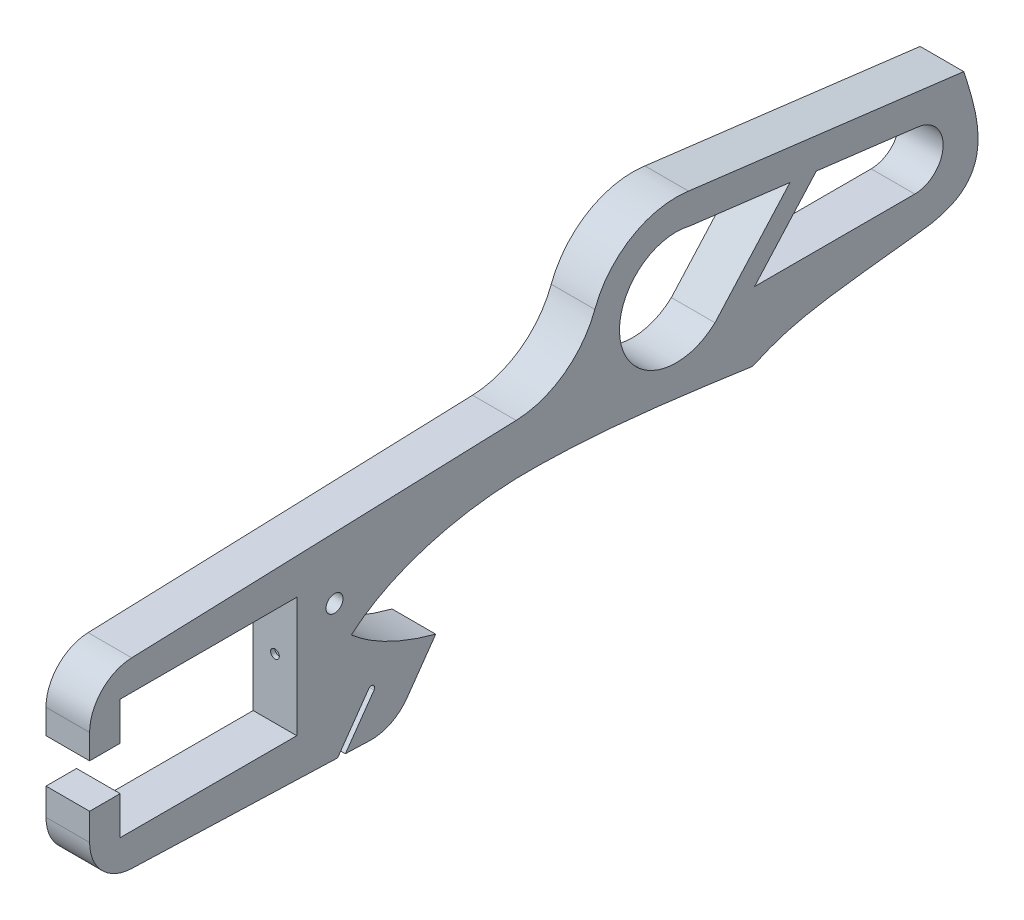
ISO-10303-21;
HEADER;
FILE_DESCRIPTION(('STEP AP214'),'2;1');
FILE_NAME('part.step','',(''),(''),'','','');
FILE_SCHEMA(('AUTOMOTIVE_DESIGN { 1 0 10303 214 1 1 1 1 }'));
ENDSEC;
DATA;
#1=APPLICATION_CONTEXT('core data for automotive mechanical design processes');
#2=APPLICATION_PROTOCOL_DEFINITION('international standard','automotive_design',2000,#1);
#3=PRODUCT_CONTEXT('',#1,'mechanical');
#4=PRODUCT('Part','Part','',(#3));
#5=PRODUCT_RELATED_PRODUCT_CATEGORY('part','',(#4));
#6=PRODUCT_DEFINITION_FORMATION('','',#4);
#7=PRODUCT_DEFINITION_CONTEXT('part definition',#1,'design');
#8=PRODUCT_DEFINITION('design','',#6,#7);
#9=PRODUCT_DEFINITION_SHAPE('','',#8);
#10=(LENGTH_UNIT() NAMED_UNIT(*) SI_UNIT(.MILLI.,.METRE.));
#11=(NAMED_UNIT(*) PLANE_ANGLE_UNIT() SI_UNIT($,.RADIAN.));
#12=(NAMED_UNIT(*) SI_UNIT($,.STERADIAN.) SOLID_ANGLE_UNIT());
#13=UNCERTAINTY_MEASURE_WITH_UNIT(LENGTH_MEASURE(1.E-05),#10,'distance_accuracy_value','');
#14=(GEOMETRIC_REPRESENTATION_CONTEXT(3) GLOBAL_UNCERTAINTY_ASSIGNED_CONTEXT((#13)) GLOBAL_UNIT_ASSIGNED_CONTEXT((#10,
#11,#12)) REPRESENTATION_CONTEXT('',''));
#15=CARTESIAN_POINT('',(0.,0.,0.));
#16=DIRECTION('',(0.,0.,1.));
#17=DIRECTION('',(1.,0.,0.));
#18=AXIS2_PLACEMENT_3D('',#15,#16,#17);
#19=CARTESIAN_POINT('',(10.,-21.2031451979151,50.3478824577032));
#20=DIRECTION('',(0.,0.99939470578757,-0.0347882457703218));
#21=DIRECTION('',(0.,0.0347882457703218,0.99939470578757));
#22=AXIS2_PLACEMENT_3D('',#19,#20,#21);
#23=PLANE('',#22);
#24=DIRECTION('',(0.,-0.0347882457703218,-0.99939470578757));
#25=VECTOR('',#24,1.);
#26=CARTESIAN_POINT('',(0.,-21.2031451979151,50.3478824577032));
#27=LINE('',#26,#25);
#28=CARTESIAN_POINT('',(0.,-21.2031451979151,50.3478824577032));
#29=VERTEX_POINT('',#28);
#30=CARTESIAN_POINT('',(0.,-22.8463212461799,3.14281629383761));
#31=VERTEX_POINT('',#30);
#32=EDGE_CURVE('E501',#29,#31,#27,.T.);
#33=ORIENTED_EDGE('',*,*,#32,.T.);
#34=DIRECTION('',(1.,0.,0.));
#35=VECTOR('',#34,1.);
#36=CARTESIAN_POINT('',(10.,-22.8463212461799,3.14281629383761));
#37=LINE('',#36,#35);
#38=CARTESIAN_POINT('',(10.,-22.8463212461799,3.14281629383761));
#39=VERTEX_POINT('',#38);
#40=EDGE_CURVE('E11',#31,#39,#37,.T.);
#41=ORIENTED_EDGE('',*,*,#40,.T.);
#42=DIRECTION('',(0.,-0.0347882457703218,-0.99939470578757));
#43=VECTOR('',#42,1.);
#44=CARTESIAN_POINT('',(10.,-21.2031451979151,50.3478824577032));
#45=LINE('',#44,#43);
#46=CARTESIAN_POINT('',(10.,-21.2031451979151,50.3478824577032));
#47=VERTEX_POINT('',#46);
#48=EDGE_CURVE('E591',#47,#39,#45,.T.);
#49=ORIENTED_EDGE('',*,*,#48,.F.);
#50=DIRECTION('',(-1.,0.,0.));
#51=VECTOR('',#50,1.);
#52=CARTESIAN_POINT('',(10.,-21.2031451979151,50.3478824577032));
#53=LINE('',#52,#51);
#54=EDGE_CURVE('E504',#47,#29,#53,.T.);
#55=ORIENTED_EDGE('',*,*,#54,.T.);
#56=EDGE_LOOP('',(#33,#41,#49,#55));
#57=FACE_BOUND('',#56,.T.);
#58=ADVANCED_FACE('F32',(#57),#23,.F.);
#59=CARTESIAN_POINT('',(10.,-5.70252850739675,-8.87915586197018));
#60=DIRECTION('',(-1.,0.,0.));
#61=DIRECTION('',(0.,0.,1.));
#62=AXIS2_PLACEMENT_3D('',#59,#60,#61);
#63=PLANE('',#62);
#64=DIRECTION('',(0.,0.12305429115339,0.992399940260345));
#65=VECTOR('',#64,1.);
#66=CARTESIAN_POINT('',(10.,35.9106898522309,-130.003351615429));
#67=LINE('',#66,#65);
#68=CARTESIAN_POINT('',(10.,35.9106898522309,-130.003351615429));
#69=VERTEX_POINT('',#68);
#70=CARTESIAN_POINT('',(10.,38.8092630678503,-106.62713402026));
#71=VERTEX_POINT('',#70);
#72=EDGE_CURVE('E284',#69,#71,#67,.T.);
#73=ORIENTED_EDGE('',*,*,#72,.F.);
#74=CARTESIAN_POINT('',(10.,29.4592694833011,-129.203396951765));
#75=DIRECTION('',(1.,0.,0.));
#76=DIRECTION('',(0.,0.,-1.));
#77=AXIS2_PLACEMENT_3D('',#74,#75,#76);
#78=CIRCLE('',#77,6.50082704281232);
#79=CARTESIAN_POINT('',(10.,22.9584424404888,-129.203396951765));
#80=VERTEX_POINT('',#79);
#81=EDGE_CURVE('E291',#80,#69,#78,.T.);
#82=ORIENTED_EDGE('',*,*,#81,.F.);
#83=DIRECTION('',(0.,0.,-1.));
#84=VECTOR('',#83,1.);
#85=CARTESIAN_POINT('',(10.,22.9584424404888,-92.4604924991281));
#86=LINE('',#85,#84);
#87=CARTESIAN_POINT('',(10.,22.9584424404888,-92.4604924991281));
#88=VERTEX_POINT('',#87);
#89=EDGE_CURVE('E289',#88,#80,#86,.T.);
#90=ORIENTED_EDGE('',*,*,#89,.F.);
#91=DIRECTION('',(0.,-0.745607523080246,0.66638534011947));
#92=VECTOR('',#91,1.);
#93=CARTESIAN_POINT('',(10.,38.8092630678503,-106.62713402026));
#94=LINE('',#93,#92);
#95=EDGE_CURVE('E286',#71,#88,#94,.T.);
#96=ORIENTED_EDGE('',*,*,#95,.F.);
#97=EDGE_LOOP('',(#73,#82,#90,#96));
#98=FACE_BOUND('',#97,.T.);
#99=ORIENTED_EDGE('',*,*,#48,.T.);
#100=DIRECTION('',(0.,0.818234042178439,-0.574885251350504));
#101=VECTOR('',#100,1.);
#102=CARTESIAN_POINT('',(10.,-12.6791192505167,-4.00058543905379));
#103=LINE('',#102,#101);
#104=CARTESIAN_POINT('',(10.,-12.6791192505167,-4.00058543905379));
#105=VERTEX_POINT('',#104);
#106=EDGE_CURVE('E252',#39,#105,#103,.T.);
#107=ORIENTED_EDGE('',*,*,#106,.T.);
#108=CARTESIAN_POINT('',(10.,-13.1102831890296,-4.61426097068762));
#109=DIRECTION('',(-1.,0.,0.));
#110=DIRECTION('',(0.,0.,1.));
#111=AXIS2_PLACEMENT_3D('',#108,#109,#110);
#112=CIRCLE('',#111,0.749999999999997);
#113=CARTESIAN_POINT('',(10.,-13.5414471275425,-5.22793650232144));
#114=VERTEX_POINT('',#113);
#115=EDGE_CURVE('E247',#105,#114,#112,.T.);
#116=ORIENTED_EDGE('',*,*,#115,.T.);
#117=DIRECTION('',(0.,-0.818234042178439,0.574885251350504));
#118=VECTOR('',#117,1.);
#119=CARTESIAN_POINT('',(10.,-24.4721318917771,2.45188263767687));
#120=LINE('',#119,#118);
#121=CARTESIAN_POINT('',(10.,-22.908610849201,1.35336419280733));
#122=VERTEX_POINT('',#121);
#123=EDGE_CURVE('E255',#114,#122,#120,.T.);
#124=ORIENTED_EDGE('',*,*,#123,.T.);
#125=CARTESIAN_POINT('',(10.,-23.1042302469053,-4.26637851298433));
#126=VERTEX_POINT('',#125);
#127=EDGE_CURVE('E579',#122,#126,#45,.T.);
#128=ORIENTED_EDGE('',*,*,#127,.T.);
#129=CARTESIAN_POINT('',(10.,-13.1102831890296,-4.61426097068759));
#130=DIRECTION('',(1.,0.,0.));
#131=DIRECTION('',(0.,0.,1.));
#132=AXIS2_PLACEMENT_3D('',#129,#130,#131);
#133=CIRCLE('',#132,10.);
#134=CARTESIAN_POINT('',(10.,-18.8591357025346,-12.796601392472));
#135=VERTEX_POINT('',#134);
#136=EDGE_CURVE('E589',#126,#135,#133,.T.);
#137=ORIENTED_EDGE('',*,*,#136,.T.);
#138=DIRECTION('',(0.,0.818234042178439,-0.574885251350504));
#139=VECTOR('',#138,1.);
#140=CARTESIAN_POINT('',(10.,-18.8591357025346,-12.796601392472));
#141=LINE('',#140,#139);
#142=CARTESIAN_POINT('',(10.,-9.51292470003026,-19.3631808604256));
#143=VERTEX_POINT('',#142);
#144=EDGE_CURVE('E520',#135,#143,#141,.T.);
#145=ORIENTED_EDGE('',*,*,#144,.T.);
#146=CARTESIAN_POINT('',(10.,-9.51292470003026,-19.3631808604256));
#147=CARTESIAN_POINT('',(10.,-7.56237200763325,-12.0547036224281));
#148=CARTESIAN_POINT('',(10.,-4.473395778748,-5.16865172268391));
#149=CARTESIAN_POINT('',(10.,0.,0.));
#150=B_SPLINE_CURVE_WITH_KNOTS('',3,(#146,#147,#148,#149),.UNSPECIFIED.,.F.,.F.,(4,4),(0.,
0.144432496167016),.UNSPECIFIED.);
#151=CARTESIAN_POINT('',(10.,0.,0.));
#152=VERTEX_POINT('',#151);
#153=EDGE_CURVE('E336',#143,#152,#150,.T.);
#154=ORIENTED_EDGE('',*,*,#153,.T.);
#155=CARTESIAN_POINT('',(10.,0.,0.));
#156=CARTESIAN_POINT('',(10.,8.67468810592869,-10.0229096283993));
#157=CARTESIAN_POINT('',(10.,12.1434163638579,-26.5039167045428));
#158=CARTESIAN_POINT('',(10.,12.2542951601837,-52.9502459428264));
#159=CARTESIAN_POINT('',(10.,10.36179643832,-70.5875064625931));
#160=CARTESIAN_POINT('',(10.,7.89754196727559,-88.025709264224));
#161=CARTESIAN_POINT('',(10.,7.32862418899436,-92.0238097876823));
#162=B_SPLINE_CURVE_WITH_KNOTS('',3,(#155,#156,#157,#158,#159,#160,#161),.UNSPECIFIED.,.F.,.F.,
(4,2,1,4),(0.,0.280079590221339,0.548831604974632,0.629025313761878),.UNSPECIFIED.);
#163=CARTESIAN_POINT('',(10.,7.32862418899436,-92.0238097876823));
#164=VERTEX_POINT('',#163);
#165=EDGE_CURVE('E342',#152,#164,#162,.T.);
#166=ORIENTED_EDGE('',*,*,#165,.T.);
#167=CARTESIAN_POINT('',(10.,7.32862418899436,-92.0238097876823));
#168=CARTESIAN_POINT('',(10.,11.7808749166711,-101.615923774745));
#169=CARTESIAN_POINT('',(10.,12.289330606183,-108.386266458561));
#170=CARTESIAN_POINT('',(10.,16.8310162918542,-147.693113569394));
#171=CARTESIAN_POINT('',(10.,28.986038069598,-144.567757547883));
#172=CARTESIAN_POINT('',(10.,41.6613306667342,-140.434725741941));
#173=B_SPLINE_CURVE_WITH_KNOTS('',3,(#167,#168,#169,#170,#171,#172),.UNSPECIFIED.,.F.,.F.,(4,2,
4),(0.115775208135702,0.613382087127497,0.980332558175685),.UNSPECIFIED.);
#174=CARTESIAN_POINT('',(10.,41.6613306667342,-140.434725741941));
#175=VERTEX_POINT('',#174);
#176=EDGE_CURVE('E351',#164,#175,#173,.T.);
#177=ORIENTED_EDGE('',*,*,#176,.T.);
#178=DIRECTION('',(0.,0.123054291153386,0.992399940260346));
#179=VECTOR('',#178,1.);
#180=CARTESIAN_POINT('',(10.,41.6613306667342,-140.434725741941));
#181=LINE('',#180,#179);
#182=CARTESIAN_POINT('',(10.,49.4858824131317,-77.3318090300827));
#183=VERTEX_POINT('',#182);
#184=EDGE_CURVE('E680',#175,#183,#181,.T.);
#185=ORIENTED_EDGE('',*,*,#184,.T.);
#186=CARTESIAN_POINT('',(10.,29.7935484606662,-74.4949381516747));
#187=DIRECTION('',(1.,0.,0.));
#188=DIRECTION('',(0.,0.,-1.));
#189=AXIS2_PLACEMENT_3D('',#186,#187,#188);
#190=CIRCLE('',#189,19.895623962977);
#191=CARTESIAN_POINT('',(10.,36.7297761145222,-55.8475630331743));
#192=VERTEX_POINT('',#191);
#193=EDGE_CURVE('E679',#183,#192,#190,.T.);
#194=ORIENTED_EDGE('',*,*,#193,.T.);
#195=CARTESIAN_POINT('',(10.,43.7023924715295,-37.1023604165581));
#196=DIRECTION('',(-1.,0.,0.));
#197=DIRECTION('',(0.,0.,-1.));
#198=AXIS2_PLACEMENT_3D('',#195,#196,#197);
#199=CIRCLE('',#198,20.);
#200=CARTESIAN_POINT('',(10.,23.7144983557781,-37.7981253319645));
#201=VERTEX_POINT('',#200);
#202=EDGE_CURVE('E677',#192,#201,#199,.T.);
#203=ORIENTED_EDGE('',*,*,#202,.T.);
#204=DIRECTION('',(0.,-0.0347882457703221,0.99939470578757));
#205=VECTOR('',#204,1.);
#206=CARTESIAN_POINT('',(10.,20.6461961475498,50.3478824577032));
#207=LINE('',#206,#205);
#208=CARTESIAN_POINT('',(10.,20.6461961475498,50.3478824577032));
#209=VERTEX_POINT('',#208);
#210=EDGE_CURVE('E675',#201,#209,#207,.T.);
#211=ORIENTED_EDGE('',*,*,#210,.T.);
#212=CARTESIAN_POINT('',(10.,10.6522490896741,50.));
#213=DIRECTION('',(1.,0.,0.));
#214=DIRECTION('',(0.,0.,-1.));
#215=AXIS2_PLACEMENT_3D('',#212,#213,#214);
#216=CIRCLE('',#215,10.);
#217=CARTESIAN_POINT('',(10.,10.6522490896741,60.));
#218=VERTEX_POINT('',#217);
#219=EDGE_CURVE('E673',#209,#218,#216,.T.);
#220=ORIENTED_EDGE('',*,*,#219,.T.);
#221=DIRECTION('',(0.,-1.,0.));
#222=VECTOR('',#221,1.);
#223=CARTESIAN_POINT('',(10.,10.6522490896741,60.));
#224=LINE('',#223,#222);
#225=CARTESIAN_POINT('',(10.,5.,60.));
#226=VERTEX_POINT('',#225);
#227=EDGE_CURVE('E671',#218,#226,#224,.T.);
#228=ORIENTED_EDGE('',*,*,#227,.T.);
#229=DIRECTION('',(0.,0.,-1.));
#230=VECTOR('',#229,1.);
#231=CARTESIAN_POINT('',(10.,5.,60.));
#232=LINE('',#231,#230);
#233=CARTESIAN_POINT('',(10.,5.,53.));
#234=VERTEX_POINT('',#233);
#235=EDGE_CURVE('E669',#226,#234,#232,.T.);
#236=ORIENTED_EDGE('',*,*,#235,.T.);
#237=DIRECTION('',(0.,1.,0.));
#238=VECTOR('',#237,1.);
#239=CARTESIAN_POINT('',(10.,13.75,53.));
#240=LINE('',#239,#238);
#241=CARTESIAN_POINT('',(10.,13.75,53.));
#242=VERTEX_POINT('',#241);
#243=EDGE_CURVE('E667',#234,#242,#240,.T.);
#244=ORIENTED_EDGE('',*,*,#243,.T.);
#245=DIRECTION('',(0.,0.,-1.));
#246=VECTOR('',#245,1.);
#247=CARTESIAN_POINT('',(10.,13.75,53.));
#248=LINE('',#247,#246);
#249=CARTESIAN_POINT('',(10.,13.75,12.5));
#250=VERTEX_POINT('',#249);
#251=EDGE_CURVE('E665',#242,#250,#248,.T.);
#252=ORIENTED_EDGE('',*,*,#251,.T.);
#253=DIRECTION('',(0.,-1.,0.));
#254=VECTOR('',#253,1.);
#255=CARTESIAN_POINT('',(10.,13.75,12.5));
#256=LINE('',#255,#254);
#257=CARTESIAN_POINT('',(10.,-13.75,12.5));
#258=VERTEX_POINT('',#257);
#259=EDGE_CURVE('E663',#250,#258,#256,.T.);
#260=ORIENTED_EDGE('',*,*,#259,.T.);
#261=DIRECTION('',(0.,0.,1.));
#262=VECTOR('',#261,1.);
#263=CARTESIAN_POINT('',(10.,-13.75,53.));
#264=LINE('',#263,#262);
#265=CARTESIAN_POINT('',(10.,-13.75,53.));
#266=VERTEX_POINT('',#265);
#267=EDGE_CURVE('E661',#258,#266,#264,.T.);
#268=ORIENTED_EDGE('',*,*,#267,.T.);
#269=DIRECTION('',(0.,1.,0.));
#270=VECTOR('',#269,1.);
#271=CARTESIAN_POINT('',(10.,-5.,53.));
#272=LINE('',#271,#270);
#273=CARTESIAN_POINT('',(10.,-5.,53.));
#274=VERTEX_POINT('',#273);
#275=EDGE_CURVE('E657',#266,#274,#272,.T.);
#276=ORIENTED_EDGE('',*,*,#275,.T.);
#277=DIRECTION('',(0.,0.,1.));
#278=VECTOR('',#277,1.);
#279=CARTESIAN_POINT('',(10.,-5.,60.));
#280=LINE('',#279,#278);
#281=CARTESIAN_POINT('',(10.,-5.,60.));
#282=VERTEX_POINT('',#281);
#283=EDGE_CURVE('E654',#274,#282,#280,.T.);
#284=ORIENTED_EDGE('',*,*,#283,.T.);
#285=DIRECTION('',(0.,-1.,0.));
#286=VECTOR('',#285,1.);
#287=CARTESIAN_POINT('',(10.,-5.,60.));
#288=LINE('',#287,#286);
#289=CARTESIAN_POINT('',(10.,-11.2091981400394,60.));
#290=VERTEX_POINT('',#289);
#291=EDGE_CURVE('E652',#282,#290,#288,.T.);
#292=ORIENTED_EDGE('',*,*,#291,.T.);
#293=CARTESIAN_POINT('',(10.,-11.2091981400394,50.));
#294=DIRECTION('',(1.,0.,0.));
#295=DIRECTION('',(0.,0.,1.));
#296=AXIS2_PLACEMENT_3D('',#293,#294,#295);
#297=CIRCLE('',#296,10.);
#298=EDGE_CURVE('E653',#290,#47,#297,.T.);
#299=ORIENTED_EDGE('',*,*,#298,.T.);
#300=EDGE_LOOP('',(#99,#107,#116,#124,#128,#137,#145,#154,#166,#177,#185,#194,#203,#211,#220,
#228,#236,#244,#252,#260,#268,#276,#284,#292,#299));
#301=FACE_BOUND('',#300,.T.);
#302=CARTESIAN_POINT('',(10.,29.7935484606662,-74.4949381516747));
#303=DIRECTION('',(1.,0.,0.));
#304=DIRECTION('',(0.,0.,-1.));
#305=AXIS2_PLACEMENT_3D('',#302,#303,#304);
#306=CIRCLE('',#305,13.);
#307=CARTESIAN_POINT('',(10.,42.3998471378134,-77.6700340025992));
#308=VERTEX_POINT('',#307);
#309=CARTESIAN_POINT('',(10.,20.3150756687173,-83.3920474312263));
#310=VERTEX_POINT('',#309);
#311=EDGE_CURVE('E313',#308,#310,#306,.T.);
#312=ORIENTED_EDGE('',*,*,#311,.F.);
#313=DIRECTION('',(0.,0.12305429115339,0.992399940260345));
#314=VECTOR('',#313,1.);
#315=CARTESIAN_POINT('',(10.,39.5578209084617,-100.590215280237));
#316=LINE('',#315,#314);
#317=CARTESIAN_POINT('',(10.,39.5578209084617,-100.590215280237));
#318=VERTEX_POINT('',#317);
#319=EDGE_CURVE('E319',#318,#308,#316,.T.);
#320=ORIENTED_EDGE('',*,*,#319,.F.);
#321=DIRECTION('',(0.,0.745607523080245,-0.66638534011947));
#322=VECTOR('',#321,1.);
#323=CARTESIAN_POINT('',(10.,20.3150756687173,-83.3920474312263));
#324=LINE('',#323,#322);
#325=EDGE_CURVE('E315',#310,#318,#324,.T.);
#326=ORIENTED_EDGE('',*,*,#325,.F.);
#327=EDGE_LOOP('',(#312,#320,#326));
#328=FACE_BOUND('',#327,.T.);
#329=CARTESIAN_POINT('',(10.,8.1877070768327,3.85519384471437));
#330=DIRECTION('',(1.,0.,0.));
#331=DIRECTION('',(0.,0.,-1.));
#332=AXIS2_PLACEMENT_3D('',#329,#330,#331);
#333=CIRCLE('',#332,1.95);
#334=CARTESIAN_POINT('',(10.,8.1877070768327,1.90519384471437));
#335=VERTEX_POINT('',#334);
#336=EDGE_CURVE('E278',#335,#335,#333,.T.);
#337=ORIENTED_EDGE('',*,*,#336,.F.);
#338=EDGE_LOOP('',(#337));
#339=FACE_BOUND('',#338,.T.);
#340=ADVANCED_FACE('F261',(#98,#301,#328,#339),#63,.F.);
#341=CARTESIAN_POINT('',(0.,-5.70252850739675,-8.87915586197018));
#342=DIRECTION('',(-1.,0.,0.));
#343=DIRECTION('',(0.,0.,1.));
#344=AXIS2_PLACEMENT_3D('',#341,#342,#343);
#345=PLANE('',#344);
#346=DIRECTION('',(0.,0.818234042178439,-0.574885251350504));
#347=VECTOR('',#346,1.);
#348=CARTESIAN_POINT('',(0.,-12.6791192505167,-4.00058543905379));
#349=LINE('',#348,#347);
#350=CARTESIAN_POINT('',(0.,-12.6791192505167,-4.00058543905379));
#351=VERTEX_POINT('',#350);
#352=EDGE_CURVE('E263',#31,#351,#349,.T.);
#353=ORIENTED_EDGE('',*,*,#352,.F.);
#354=ORIENTED_EDGE('',*,*,#32,.F.);
#355=CARTESIAN_POINT('',(0.,-11.2091981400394,50.));
#356=DIRECTION('',(1.,0.,0.));
#357=DIRECTION('',(0.,0.,1.));
#358=AXIS2_PLACEMENT_3D('',#355,#356,#357);
#359=CIRCLE('',#358,10.);
#360=CARTESIAN_POINT('',(0.,-11.2091981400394,60.));
#361=VERTEX_POINT('',#360);
#362=EDGE_CURVE('E511',#361,#29,#359,.T.);
#363=ORIENTED_EDGE('',*,*,#362,.F.);
#364=DIRECTION('',(0.,-1.,0.));
#365=VECTOR('',#364,1.);
#366=CARTESIAN_POINT('',(0.,-5.,60.));
#367=LINE('',#366,#365);
#368=CARTESIAN_POINT('',(0.,-5.,60.));
#369=VERTEX_POINT('',#368);
#370=EDGE_CURVE('E641',#369,#361,#367,.T.);
#371=ORIENTED_EDGE('',*,*,#370,.F.);
#372=DIRECTION('',(0.,0.,1.));
#373=VECTOR('',#372,1.);
#374=CARTESIAN_POINT('',(0.,-5.,60.));
#375=LINE('',#374,#373);
#376=CARTESIAN_POINT('',(0.,-5.,53.));
#377=VERTEX_POINT('',#376);
#378=EDGE_CURVE('E640',#377,#369,#375,.T.);
#379=ORIENTED_EDGE('',*,*,#378,.F.);
#380=DIRECTION('',(0.,1.,0.));
#381=VECTOR('',#380,1.);
#382=CARTESIAN_POINT('',(0.,-5.,53.));
#383=LINE('',#382,#381);
#384=CARTESIAN_POINT('',(0.,-13.75,53.));
#385=VERTEX_POINT('',#384);
#386=EDGE_CURVE('E638',#385,#377,#383,.T.);
#387=ORIENTED_EDGE('',*,*,#386,.F.);
#388=DIRECTION('',(0.,0.,1.));
#389=VECTOR('',#388,1.);
#390=CARTESIAN_POINT('',(0.,-13.75,53.));
#391=LINE('',#390,#389);
#392=CARTESIAN_POINT('',(0.,-13.75,12.5));
#393=VERTEX_POINT('',#392);
#394=EDGE_CURVE('E636',#393,#385,#391,.T.);
#395=ORIENTED_EDGE('',*,*,#394,.F.);
#396=DIRECTION('',(0.,-1.,0.));
#397=VECTOR('',#396,1.);
#398=CARTESIAN_POINT('',(0.,13.75,12.5));
#399=LINE('',#398,#397);
#400=CARTESIAN_POINT('',(0.,13.75,12.5));
#401=VERTEX_POINT('',#400);
#402=EDGE_CURVE('E634',#401,#393,#399,.T.);
#403=ORIENTED_EDGE('',*,*,#402,.F.);
#404=DIRECTION('',(0.,0.,-1.));
#405=VECTOR('',#404,1.);
#406=CARTESIAN_POINT('',(0.,13.75,53.));
#407=LINE('',#406,#405);
#408=CARTESIAN_POINT('',(0.,13.75,53.));
#409=VERTEX_POINT('',#408);
#410=EDGE_CURVE('E632',#409,#401,#407,.T.);
#411=ORIENTED_EDGE('',*,*,#410,.F.);
#412=DIRECTION('',(0.,1.,0.));
#413=VECTOR('',#412,1.);
#414=CARTESIAN_POINT('',(0.,13.75,53.));
#415=LINE('',#414,#413);
#416=CARTESIAN_POINT('',(0.,5.,53.));
#417=VERTEX_POINT('',#416);
#418=EDGE_CURVE('E630',#417,#409,#415,.T.);
#419=ORIENTED_EDGE('',*,*,#418,.F.);
#420=DIRECTION('',(0.,0.,-1.));
#421=VECTOR('',#420,1.);
#422=CARTESIAN_POINT('',(0.,5.,60.));
#423=LINE('',#422,#421);
#424=CARTESIAN_POINT('',(0.,5.,60.));
#425=VERTEX_POINT('',#424);
#426=EDGE_CURVE('E628',#425,#417,#423,.T.);
#427=ORIENTED_EDGE('',*,*,#426,.F.);
#428=DIRECTION('',(0.,-1.,0.));
#429=VECTOR('',#428,1.);
#430=CARTESIAN_POINT('',(0.,10.6522490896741,60.));
#431=LINE('',#430,#429);
#432=CARTESIAN_POINT('',(0.,10.6522490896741,60.));
#433=VERTEX_POINT('',#432);
#434=EDGE_CURVE('E626',#433,#425,#431,.T.);
#435=ORIENTED_EDGE('',*,*,#434,.F.);
#436=CARTESIAN_POINT('',(0.,10.6522490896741,50.));
#437=DIRECTION('',(1.,0.,0.));
#438=DIRECTION('',(0.,0.,-1.));
#439=AXIS2_PLACEMENT_3D('',#436,#437,#438);
#440=CIRCLE('',#439,10.);
#441=CARTESIAN_POINT('',(0.,20.6461961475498,50.3478824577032));
#442=VERTEX_POINT('',#441);
#443=EDGE_CURVE('E624',#442,#433,#440,.T.);
#444=ORIENTED_EDGE('',*,*,#443,.F.);
#445=DIRECTION('',(0.,-0.0347882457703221,0.99939470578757));
#446=VECTOR('',#445,1.);
#447=CARTESIAN_POINT('',(0.,20.6461961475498,50.3478824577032));
#448=LINE('',#447,#446);
#449=CARTESIAN_POINT('',(0.,23.7144983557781,-37.7981253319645));
#450=VERTEX_POINT('',#449);
#451=EDGE_CURVE('E622',#450,#442,#448,.T.);
#452=ORIENTED_EDGE('',*,*,#451,.F.);
#453=CARTESIAN_POINT('',(0.,43.7023924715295,-37.1023604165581));
#454=DIRECTION('',(-1.,0.,0.));
#455=DIRECTION('',(0.,0.,-1.));
#456=AXIS2_PLACEMENT_3D('',#453,#454,#455);
#457=CIRCLE('',#456,20.);
#458=CARTESIAN_POINT('',(0.,36.7297761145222,-55.8475630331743));
#459=VERTEX_POINT('',#458);
#460=EDGE_CURVE('E620',#459,#450,#457,.T.);
#461=ORIENTED_EDGE('',*,*,#460,.F.);
#462=CARTESIAN_POINT('',(0.,29.7935484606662,-74.4949381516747));
#463=DIRECTION('',(1.,0.,0.));
#464=DIRECTION('',(0.,0.,-1.));
#465=AXIS2_PLACEMENT_3D('',#462,#463,#464);
#466=CIRCLE('',#465,19.895623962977);
#467=CARTESIAN_POINT('',(0.,49.4858824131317,-77.3318090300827));
#468=VERTEX_POINT('',#467);
#469=EDGE_CURVE('E618',#468,#459,#466,.T.);
#470=ORIENTED_EDGE('',*,*,#469,.F.);
#471=DIRECTION('',(0.,0.123054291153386,0.992399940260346));
#472=VECTOR('',#471,1.);
#473=CARTESIAN_POINT('',(0.,41.6613306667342,-140.434725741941));
#474=LINE('',#473,#472);
#475=CARTESIAN_POINT('',(0.,41.6613306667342,-140.434725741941));
#476=VERTEX_POINT('',#475);
#477=EDGE_CURVE('E613',#476,#468,#474,.T.);
#478=ORIENTED_EDGE('',*,*,#477,.F.);
#479=CARTESIAN_POINT('',(0.,7.32862418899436,-92.0238097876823));
#480=CARTESIAN_POINT('',(0.,11.7808749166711,-101.615923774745));
#481=CARTESIAN_POINT('',(0.,12.289330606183,-108.386266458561));
#482=CARTESIAN_POINT('',(0.,16.8310162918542,-147.693113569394));
#483=CARTESIAN_POINT('',(0.,28.986038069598,-144.567757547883));
#484=CARTESIAN_POINT('',(0.,41.6613306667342,-140.434725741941));
#485=B_SPLINE_CURVE_WITH_KNOTS('',3,(#479,#480,#481,#482,#483,#484),.UNSPECIFIED.,.F.,.F.,(4,2,
4),(0.115775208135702,0.613382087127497,0.980332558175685),.UNSPECIFIED.);
#486=CARTESIAN_POINT('',(0.,7.32862418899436,-92.0238097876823));
#487=VERTEX_POINT('',#486);
#488=EDGE_CURVE('E606',#487,#476,#485,.T.);
#489=ORIENTED_EDGE('',*,*,#488,.F.);
#490=CARTESIAN_POINT('',(0.,0.,0.));
#491=CARTESIAN_POINT('',(0.,8.67468810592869,-10.0229096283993));
#492=CARTESIAN_POINT('',(0.,12.1434163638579,-26.5039167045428));
#493=CARTESIAN_POINT('',(0.,12.2542951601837,-52.9502459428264));
#494=CARTESIAN_POINT('',(0.,10.36179643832,-70.5875064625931));
#495=CARTESIAN_POINT('',(0.,7.89754196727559,-88.025709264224));
#496=CARTESIAN_POINT('',(0.,7.32862418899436,-92.0238097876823));
#497=B_SPLINE_CURVE_WITH_KNOTS('',3,(#490,#491,#492,#493,#494,#495,#496),.UNSPECIFIED.,.F.,.F.,
(4,2,1,4),(0.,0.280079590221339,0.548831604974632,0.629025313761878),.UNSPECIFIED.);
#498=CARTESIAN_POINT('',(0.,0.,0.));
#499=VERTEX_POINT('',#498);
#500=EDGE_CURVE('E599',#499,#487,#497,.T.);
#501=ORIENTED_EDGE('',*,*,#500,.F.);
#502=CARTESIAN_POINT('',(0.,-9.51292470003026,-19.3631808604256));
#503=CARTESIAN_POINT('',(0.,-7.56237200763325,-12.0547036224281));
#504=CARTESIAN_POINT('',(0.,-4.473395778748,-5.16865172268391));
#505=CARTESIAN_POINT('',(0.,0.,0.));
#506=B_SPLINE_CURVE_WITH_KNOTS('',3,(#502,#503,#504,#505),.UNSPECIFIED.,.F.,.F.,(4,4),(0.,
0.144432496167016),.UNSPECIFIED.);
#507=CARTESIAN_POINT('',(0.,-9.51292470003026,-19.3631808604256));
#508=VERTEX_POINT('',#507);
#509=EDGE_CURVE('E335',#508,#499,#506,.T.);
#510=ORIENTED_EDGE('',*,*,#509,.F.);
#511=DIRECTION('',(0.,0.818234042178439,-0.574885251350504));
#512=VECTOR('',#511,1.);
#513=CARTESIAN_POINT('',(0.,-18.8591357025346,-12.796601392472));
#514=LINE('',#513,#512);
#515=CARTESIAN_POINT('',(0.,-18.8591357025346,-12.796601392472));
#516=VERTEX_POINT('',#515);
#517=EDGE_CURVE('E343',#516,#508,#514,.T.);
#518=ORIENTED_EDGE('',*,*,#517,.F.);
#519=CARTESIAN_POINT('',(0.,-13.1102831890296,-4.61426097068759));
#520=DIRECTION('',(1.,0.,0.));
#521=DIRECTION('',(0.,0.,1.));
#522=AXIS2_PLACEMENT_3D('',#519,#520,#521);
#523=CIRCLE('',#522,10.);
#524=CARTESIAN_POINT('',(0.,-23.1042302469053,-4.26637851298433));
#525=VERTEX_POINT('',#524);
#526=EDGE_CURVE('E507',#525,#516,#523,.T.);
#527=ORIENTED_EDGE('',*,*,#526,.F.);
#528=CARTESIAN_POINT('',(0.,-22.908610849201,1.35336419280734));
#529=VERTEX_POINT('',#528);
#530=EDGE_CURVE('E508',#529,#525,#27,.T.);
#531=ORIENTED_EDGE('',*,*,#530,.F.);
#532=DIRECTION('',(0.,-0.818234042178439,0.574885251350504));
#533=VECTOR('',#532,1.);
#534=CARTESIAN_POINT('',(0.,-24.4721318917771,2.45188263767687));
#535=LINE('',#534,#533);
#536=CARTESIAN_POINT('',(0.,-13.5414471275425,-5.22793650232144));
#537=VERTEX_POINT('',#536);
#538=EDGE_CURVE('E48',#537,#529,#535,.T.);
#539=ORIENTED_EDGE('',*,*,#538,.F.);
#540=CARTESIAN_POINT('',(0.,-13.1102831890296,-4.61426097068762));
#541=DIRECTION('',(-1.,0.,0.));
#542=DIRECTION('',(0.,0.,1.));
#543=AXIS2_PLACEMENT_3D('',#540,#541,#542);
#544=CIRCLE('',#543,0.749999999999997);
#545=EDGE_CURVE('E250',#351,#537,#544,.T.);
#546=ORIENTED_EDGE('',*,*,#545,.F.);
#547=EDGE_LOOP('',(#353,#354,#363,#371,#379,#387,#395,#403,#411,#419,#427,#435,#444,#452,#461,
#470,#478,#489,#501,#510,#518,#527,#531,#539,#546));
#548=FACE_BOUND('',#547,.T.);
#549=CARTESIAN_POINT('',(0.,29.4592694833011,-129.203396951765));
#550=DIRECTION('',(1.,0.,0.));
#551=DIRECTION('',(0.,0.,-1.));
#552=AXIS2_PLACEMENT_3D('',#549,#550,#551);
#553=CIRCLE('',#552,6.50082704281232);
#554=CARTESIAN_POINT('',(0.,22.9584424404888,-129.203396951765));
#555=VERTEX_POINT('',#554);
#556=CARTESIAN_POINT('',(0.,35.9106898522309,-130.003351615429));
#557=VERTEX_POINT('',#556);
#558=EDGE_CURVE('E287',#555,#557,#553,.T.);
#559=ORIENTED_EDGE('',*,*,#558,.T.);
#560=DIRECTION('',(0.,0.12305429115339,0.992399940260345));
#561=VECTOR('',#560,1.);
#562=CARTESIAN_POINT('',(0.,35.9106898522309,-130.003351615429));
#563=LINE('',#562,#561);
#564=CARTESIAN_POINT('',(0.,38.8092630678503,-106.62713402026));
#565=VERTEX_POINT('',#564);
#566=EDGE_CURVE('E281',#557,#565,#563,.T.);
#567=ORIENTED_EDGE('',*,*,#566,.T.);
#568=DIRECTION('',(0.,-0.745607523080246,0.66638534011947));
#569=VECTOR('',#568,1.);
#570=CARTESIAN_POINT('',(0.,38.8092630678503,-106.62713402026));
#571=LINE('',#570,#569);
#572=CARTESIAN_POINT('',(0.,22.9584424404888,-92.4604924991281));
#573=VERTEX_POINT('',#572);
#574=EDGE_CURVE('E296',#565,#573,#571,.T.);
#575=ORIENTED_EDGE('',*,*,#574,.T.);
#576=DIRECTION('',(0.,0.,-1.));
#577=VECTOR('',#576,1.);
#578=CARTESIAN_POINT('',(0.,22.9584424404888,-92.4604924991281));
#579=LINE('',#578,#577);
#580=EDGE_CURVE('E299',#573,#555,#579,.T.);
#581=ORIENTED_EDGE('',*,*,#580,.T.);
#582=EDGE_LOOP('',(#559,#567,#575,#581));
#583=FACE_BOUND('',#582,.T.);
#584=DIRECTION('',(0.,0.12305429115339,0.992399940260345));
#585=VECTOR('',#584,1.);
#586=CARTESIAN_POINT('',(0.,39.5578209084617,-100.590215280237));
#587=LINE('',#586,#585);
#588=CARTESIAN_POINT('',(0.,39.5578209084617,-100.590215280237));
#589=VERTEX_POINT('',#588);
#590=CARTESIAN_POINT('',(0.,42.3998471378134,-77.6700340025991));
#591=VERTEX_POINT('',#590);
#592=EDGE_CURVE('E316',#589,#591,#587,.T.);
#593=ORIENTED_EDGE('',*,*,#592,.T.);
#594=CARTESIAN_POINT('',(0.,29.7935484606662,-74.4949381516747));
#595=DIRECTION('',(1.,0.,0.));
#596=DIRECTION('',(0.,0.,-1.));
#597=AXIS2_PLACEMENT_3D('',#594,#595,#596);
#598=CIRCLE('',#597,13.);
#599=CARTESIAN_POINT('',(0.,20.3150756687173,-83.3920474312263));
#600=VERTEX_POINT('',#599);
#601=EDGE_CURVE('E312',#591,#600,#598,.T.);
#602=ORIENTED_EDGE('',*,*,#601,.T.);
#603=DIRECTION('',(0.,0.745607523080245,-0.66638534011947));
#604=VECTOR('',#603,1.);
#605=CARTESIAN_POINT('',(0.,20.3150756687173,-83.3920474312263));
#606=LINE('',#605,#604);
#607=EDGE_CURVE('E324',#600,#589,#606,.T.);
#608=ORIENTED_EDGE('',*,*,#607,.T.);
#609=EDGE_LOOP('',(#593,#602,#608));
#610=FACE_BOUND('',#609,.T.);
#611=CARTESIAN_POINT('',(0.,8.1877070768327,3.85519384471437));
#612=DIRECTION('',(1.,0.,0.));
#613=DIRECTION('',(0.,0.,-1.));
#614=AXIS2_PLACEMENT_3D('',#611,#612,#613);
#615=CIRCLE('',#614,1.95);
#616=CARTESIAN_POINT('',(0.,8.1877070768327,1.90519384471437));
#617=VERTEX_POINT('',#616);
#618=EDGE_CURVE('E275',#617,#617,#615,.T.);
#619=ORIENTED_EDGE('',*,*,#618,.T.);
#620=EDGE_LOOP('',(#619));
#621=FACE_BOUND('',#620,.T.);
#622=ADVANCED_FACE('F440',(#548,#583,#610,#621),#345,.T.);
#623=DIRECTION('',(-1.,0.,0.));
#624=VECTOR('',#623,1.);
#625=SURFACE_OF_LINEAR_EXTRUSION('',#150,#624);
#626=ORIENTED_EDGE('',*,*,#509,.T.);
#627=DIRECTION('',(-1.,0.,0.));
#628=VECTOR('',#627,1.);
#629=CARTESIAN_POINT('',(10.,0.,0.));
#630=LINE('',#629,#628);
#631=EDGE_CURVE('E575',#152,#499,#630,.T.);
#632=ORIENTED_EDGE('',*,*,#631,.F.);
#633=ORIENTED_EDGE('',*,*,#153,.F.);
#634=DIRECTION('',(-1.,0.,0.));
#635=VECTOR('',#634,1.);
#636=CARTESIAN_POINT('',(10.,-9.51292470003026,-19.3631808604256));
#637=LINE('',#636,#635);
#638=EDGE_CURVE('E516',#143,#508,#637,.T.);
#639=ORIENTED_EDGE('',*,*,#638,.T.);
#640=EDGE_LOOP('',(#626,#632,#633,#639));
#641=FACE_BOUND('',#640,.T.);
#642=ADVANCED_FACE('F34',(#641),#625,.F.);
#643=DIRECTION('',(-1.,0.,0.));
#644=VECTOR('',#643,1.);
#645=SURFACE_OF_LINEAR_EXTRUSION('',#162,#644);
#646=ORIENTED_EDGE('',*,*,#500,.T.);
#647=DIRECTION('',(-1.,0.,0.));
#648=VECTOR('',#647,1.);
#649=CARTESIAN_POINT('',(10.,7.32862418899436,-92.0238097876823));
#650=LINE('',#649,#648);
#651=EDGE_CURVE('E572',#164,#487,#650,.T.);
#652=ORIENTED_EDGE('',*,*,#651,.F.);
#653=ORIENTED_EDGE('',*,*,#165,.F.);
#654=ORIENTED_EDGE('',*,*,#631,.T.);
#655=EDGE_LOOP('',(#646,#652,#653,#654));
#656=FACE_BOUND('',#655,.T.);
#657=ADVANCED_FACE('F359',(#656),#645,.F.);
#658=DIRECTION('',(-1.,0.,0.));
#659=VECTOR('',#658,1.);
#660=SURFACE_OF_LINEAR_EXTRUSION('',#173,#659);
#661=ORIENTED_EDGE('',*,*,#488,.T.);
#662=DIRECTION('',(-1.,0.,0.));
#663=VECTOR('',#662,1.);
#664=CARTESIAN_POINT('',(10.,41.6613306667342,-140.434725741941));
#665=LINE('',#664,#663);
#666=EDGE_CURVE('E569',#175,#476,#665,.T.);
#667=ORIENTED_EDGE('',*,*,#666,.F.);
#668=ORIENTED_EDGE('',*,*,#176,.F.);
#669=ORIENTED_EDGE('',*,*,#651,.T.);
#670=EDGE_LOOP('',(#661,#667,#668,#669));
#671=FACE_BOUND('',#670,.T.);
#672=ADVANCED_FACE('F362',(#671),#660,.F.);
#673=CARTESIAN_POINT('',(10.,41.6613306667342,-140.434725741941));
#674=DIRECTION('',(0.,-0.992399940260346,0.123054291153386));
#675=DIRECTION('',(0.,-0.123054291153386,-0.992399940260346));
#676=AXIS2_PLACEMENT_3D('',#673,#674,#675);
#677=PLANE('',#676);
#678=ORIENTED_EDGE('',*,*,#477,.T.);
#679=DIRECTION('',(-1.,0.,0.));
#680=VECTOR('',#679,1.);
#681=CARTESIAN_POINT('',(10.,49.4858824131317,-77.3318090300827));
#682=LINE('',#681,#680);
#683=EDGE_CURVE('E566',#183,#468,#682,.T.);
#684=ORIENTED_EDGE('',*,*,#683,.F.);
#685=ORIENTED_EDGE('',*,*,#184,.F.);
#686=ORIENTED_EDGE('',*,*,#666,.T.);
#687=EDGE_LOOP('',(#678,#684,#685,#686));
#688=FACE_BOUND('',#687,.T.);
#689=ADVANCED_FACE('F366',(#688),#677,.F.);
#690=CARTESIAN_POINT('',(10.,29.7935484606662,-74.4949381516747));
#691=DIRECTION('',(-1.,0.,0.));
#692=DIRECTION('',(0.,0.,1.));
#693=AXIS2_PLACEMENT_3D('',#690,#691,#692);
#694=CYLINDRICAL_SURFACE('',#693,19.895623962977);
#695=ORIENTED_EDGE('',*,*,#469,.T.);
#696=DIRECTION('',(-1.,0.,0.));
#697=VECTOR('',#696,1.);
#698=CARTESIAN_POINT('',(10.,36.7297761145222,-55.8475630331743));
#699=LINE('',#698,#697);
#700=EDGE_CURVE('E563',#192,#459,#699,.T.);
#701=ORIENTED_EDGE('',*,*,#700,.F.);
#702=ORIENTED_EDGE('',*,*,#193,.F.);
#703=ORIENTED_EDGE('',*,*,#683,.T.);
#704=EDGE_LOOP('',(#695,#701,#702,#703));
#705=FACE_BOUND('',#704,.T.);
#706=ADVANCED_FACE('F370',(#705),#694,.T.);
#707=CARTESIAN_POINT('',(10.,43.7023924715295,-37.1023604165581));
#708=DIRECTION('',(-1.,0.,0.));
#709=DIRECTION('',(0.,0.,1.));
#710=AXIS2_PLACEMENT_3D('',#707,#708,#709);
#711=CYLINDRICAL_SURFACE('',#710,20.);
#712=ORIENTED_EDGE('',*,*,#460,.T.);
#713=DIRECTION('',(-1.,0.,0.));
#714=VECTOR('',#713,1.);
#715=CARTESIAN_POINT('',(10.,23.7144983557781,-37.7981253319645));
#716=LINE('',#715,#714);
#717=EDGE_CURVE('E560',#201,#450,#716,.T.);
#718=ORIENTED_EDGE('',*,*,#717,.F.);
#719=ORIENTED_EDGE('',*,*,#202,.F.);
#720=ORIENTED_EDGE('',*,*,#700,.T.);
#721=EDGE_LOOP('',(#712,#718,#719,#720));
#722=FACE_BOUND('',#721,.T.);
#723=ADVANCED_FACE('F374',(#722),#711,.F.);
#724=CARTESIAN_POINT('',(10.,20.6461961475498,50.3478824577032));
#725=DIRECTION('',(0.,-0.99939470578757,-0.0347882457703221));
#726=DIRECTION('',(0.,0.0347882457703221,-0.99939470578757));
#727=AXIS2_PLACEMENT_3D('',#724,#725,#726);
#728=PLANE('',#727);
#729=ORIENTED_EDGE('',*,*,#451,.T.);
#730=DIRECTION('',(-1.,0.,0.));
#731=VECTOR('',#730,1.);
#732=CARTESIAN_POINT('',(10.,20.6461961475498,50.3478824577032));
#733=LINE('',#732,#731);
#734=EDGE_CURVE('E557',#209,#442,#733,.T.);
#735=ORIENTED_EDGE('',*,*,#734,.F.);
#736=ORIENTED_EDGE('',*,*,#210,.F.);
#737=ORIENTED_EDGE('',*,*,#717,.T.);
#738=EDGE_LOOP('',(#729,#735,#736,#737));
#739=FACE_BOUND('',#738,.T.);
#740=ADVANCED_FACE('F378',(#739),#728,.F.);
#741=CARTESIAN_POINT('',(10.,10.6522490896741,50.));
#742=DIRECTION('',(-1.,0.,0.));
#743=DIRECTION('',(0.,0.,1.));
#744=AXIS2_PLACEMENT_3D('',#741,#742,#743);
#745=CYLINDRICAL_SURFACE('',#744,10.);
#746=ORIENTED_EDGE('',*,*,#443,.T.);
#747=DIRECTION('',(-1.,0.,0.));
#748=VECTOR('',#747,1.);
#749=CARTESIAN_POINT('',(10.,10.6522490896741,60.));
#750=LINE('',#749,#748);
#751=EDGE_CURVE('E554',#218,#433,#750,.T.);
#752=ORIENTED_EDGE('',*,*,#751,.F.);
#753=ORIENTED_EDGE('',*,*,#219,.F.);
#754=ORIENTED_EDGE('',*,*,#734,.T.);
#755=EDGE_LOOP('',(#746,#752,#753,#754));
#756=FACE_BOUND('',#755,.T.);
#757=ADVANCED_FACE('F382',(#756),#745,.T.);
#758=CARTESIAN_POINT('',(10.,10.6522490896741,60.));
#759=DIRECTION('',(0.,0.,-1.));
#760=DIRECTION('',(-1.,0.,0.));
#761=AXIS2_PLACEMENT_3D('',#758,#759,#760);
#762=PLANE('',#761);
#763=ORIENTED_EDGE('',*,*,#434,.T.);
#764=DIRECTION('',(-1.,0.,0.));
#765=VECTOR('',#764,1.);
#766=CARTESIAN_POINT('',(10.,5.,60.));
#767=LINE('',#766,#765);
#768=EDGE_CURVE('E551',#226,#425,#767,.T.);
#769=ORIENTED_EDGE('',*,*,#768,.F.);
#770=ORIENTED_EDGE('',*,*,#227,.F.);
#771=ORIENTED_EDGE('',*,*,#751,.T.);
#772=EDGE_LOOP('',(#763,#769,#770,#771));
#773=FACE_BOUND('',#772,.T.);
#774=ADVANCED_FACE('F386',(#773),#762,.F.);
#775=CARTESIAN_POINT('',(10.,5.,60.));
#776=DIRECTION('',(0.,1.,0.));
#777=DIRECTION('',(0.,0.,1.));
#778=AXIS2_PLACEMENT_3D('',#775,#776,#777);
#779=PLANE('',#778);
#780=ORIENTED_EDGE('',*,*,#426,.T.);
#781=DIRECTION('',(-1.,0.,0.));
#782=VECTOR('',#781,1.);
#783=CARTESIAN_POINT('',(10.,5.,53.));
#784=LINE('',#783,#782);
#785=EDGE_CURVE('E548',#234,#417,#784,.T.);
#786=ORIENTED_EDGE('',*,*,#785,.F.);
#787=ORIENTED_EDGE('',*,*,#235,.F.);
#788=ORIENTED_EDGE('',*,*,#768,.T.);
#789=EDGE_LOOP('',(#780,#786,#787,#788));
#790=FACE_BOUND('',#789,.T.);
#791=ADVANCED_FACE('F390',(#790),#779,.F.);
#792=CARTESIAN_POINT('',(10.,13.75,53.));
#793=DIRECTION('',(0.,0.,1.));
#794=DIRECTION('',(0.,-1.,0.));
#795=AXIS2_PLACEMENT_3D('',#792,#793,#794);
#796=PLANE('',#795);
#797=ORIENTED_EDGE('',*,*,#418,.T.);
#798=DIRECTION('',(-1.,0.,0.));
#799=VECTOR('',#798,1.);
#800=CARTESIAN_POINT('',(10.,13.75,53.));
#801=LINE('',#800,#799);
#802=EDGE_CURVE('E545',#242,#409,#801,.T.);
#803=ORIENTED_EDGE('',*,*,#802,.F.);
#804=ORIENTED_EDGE('',*,*,#243,.F.);
#805=ORIENTED_EDGE('',*,*,#785,.T.);
#806=EDGE_LOOP('',(#797,#803,#804,#805));
#807=FACE_BOUND('',#806,.T.);
#808=ADVANCED_FACE('F394',(#807),#796,.F.);
#809=CARTESIAN_POINT('',(10.,13.75,53.));
#810=DIRECTION('',(0.,1.,0.));
#811=DIRECTION('',(0.,0.,1.));
#812=AXIS2_PLACEMENT_3D('',#809,#810,#811);
#813=PLANE('',#812);
#814=ORIENTED_EDGE('',*,*,#410,.T.);
#815=DIRECTION('',(-1.,0.,0.));
#816=VECTOR('',#815,1.);
#817=CARTESIAN_POINT('',(10.,13.75,12.5));
#818=LINE('',#817,#816);
#819=EDGE_CURVE('E542',#250,#401,#818,.T.);
#820=ORIENTED_EDGE('',*,*,#819,.F.);
#821=ORIENTED_EDGE('',*,*,#251,.F.);
#822=ORIENTED_EDGE('',*,*,#802,.T.);
#823=EDGE_LOOP('',(#814,#820,#821,#822));
#824=FACE_BOUND('',#823,.T.);
#825=ADVANCED_FACE('F398',(#824),#813,.F.);
#826=CARTESIAN_POINT('',(10.,13.75,12.5));
#827=DIRECTION('',(0.,0.,-1.));
#828=DIRECTION('',(0.,1.,0.));
#829=AXIS2_PLACEMENT_3D('',#826,#827,#828);
#830=PLANE('',#829);
#831=CARTESIAN_POINT('',(5.,0.,12.5));
#832=DIRECTION('',(0.,0.,1.));
#833=DIRECTION('',(1.,0.,0.));
#834=AXIS2_PLACEMENT_3D('',#831,#832,#833);
#835=CIRCLE('',#834,1.);
#836=CARTESIAN_POINT('',(6.,0.,12.5));
#837=VERTEX_POINT('',#836);
#838=EDGE_CURVE('E270',#837,#837,#835,.T.);
#839=ORIENTED_EDGE('',*,*,#838,.F.);
#840=EDGE_LOOP('',(#839));
#841=FACE_BOUND('',#840,.T.);
#842=ORIENTED_EDGE('',*,*,#402,.T.);
#843=DIRECTION('',(-1.,0.,0.));
#844=VECTOR('',#843,1.);
#845=CARTESIAN_POINT('',(10.,-13.75,12.5));
#846=LINE('',#845,#844);
#847=EDGE_CURVE('E539',#258,#393,#846,.T.);
#848=ORIENTED_EDGE('',*,*,#847,.F.);
#849=ORIENTED_EDGE('',*,*,#259,.F.);
#850=ORIENTED_EDGE('',*,*,#819,.T.);
#851=EDGE_LOOP('',(#842,#848,#849,#850));
#852=FACE_BOUND('',#851,.T.);
#853=ADVANCED_FACE('F402',(#841,#852),#830,.F.);
#854=CARTESIAN_POINT('',(10.,-13.75,53.));
#855=DIRECTION('',(0.,-1.,0.));
#856=DIRECTION('',(0.,0.,-1.));
#857=AXIS2_PLACEMENT_3D('',#854,#855,#856);
#858=PLANE('',#857);
#859=ORIENTED_EDGE('',*,*,#394,.T.);
#860=DIRECTION('',(-1.,0.,0.));
#861=VECTOR('',#860,1.);
#862=CARTESIAN_POINT('',(10.,-13.75,53.));
#863=LINE('',#862,#861);
#864=EDGE_CURVE('E536',#266,#385,#863,.T.);
#865=ORIENTED_EDGE('',*,*,#864,.F.);
#866=ORIENTED_EDGE('',*,*,#267,.F.);
#867=ORIENTED_EDGE('',*,*,#847,.T.);
#868=EDGE_LOOP('',(#859,#865,#866,#867));
#869=FACE_BOUND('',#868,.T.);
#870=ADVANCED_FACE('F406',(#869),#858,.F.);
#871=CARTESIAN_POINT('',(10.,-5.,53.));
#872=DIRECTION('',(0.,0.,1.));
#873=DIRECTION('',(0.,-1.,0.));
#874=AXIS2_PLACEMENT_3D('',#871,#872,#873);
#875=PLANE('',#874);
#876=ORIENTED_EDGE('',*,*,#386,.T.);
#877=DIRECTION('',(-1.,0.,0.));
#878=VECTOR('',#877,1.);
#879=CARTESIAN_POINT('',(10.,-5.,53.));
#880=LINE('',#879,#878);
#881=EDGE_CURVE('E533',#274,#377,#880,.T.);
#882=ORIENTED_EDGE('',*,*,#881,.F.);
#883=ORIENTED_EDGE('',*,*,#275,.F.);
#884=ORIENTED_EDGE('',*,*,#864,.T.);
#885=EDGE_LOOP('',(#876,#882,#883,#884));
#886=FACE_BOUND('',#885,.T.);
#887=ADVANCED_FACE('F410',(#886),#875,.F.);
#888=CARTESIAN_POINT('',(10.,-5.,60.));
#889=DIRECTION('',(0.,-1.,0.));
#890=DIRECTION('',(0.,0.,-1.));
#891=AXIS2_PLACEMENT_3D('',#888,#889,#890);
#892=PLANE('',#891);
#893=ORIENTED_EDGE('',*,*,#378,.T.);
#894=DIRECTION('',(-1.,0.,0.));
#895=VECTOR('',#894,1.);
#896=CARTESIAN_POINT('',(10.,-5.,60.));
#897=LINE('',#896,#895);
#898=EDGE_CURVE('E530',#282,#369,#897,.T.);
#899=ORIENTED_EDGE('',*,*,#898,.F.);
#900=ORIENTED_EDGE('',*,*,#283,.F.);
#901=ORIENTED_EDGE('',*,*,#881,.T.);
#902=EDGE_LOOP('',(#893,#899,#900,#901));
#903=FACE_BOUND('',#902,.T.);
#904=ADVANCED_FACE('F414',(#903),#892,.F.);
#905=CARTESIAN_POINT('',(10.,-5.,60.));
#906=DIRECTION('',(0.,0.,-1.));
#907=DIRECTION('',(-1.,0.,0.));
#908=AXIS2_PLACEMENT_3D('',#905,#906,#907);
#909=PLANE('',#908);
#910=ORIENTED_EDGE('',*,*,#370,.T.);
#911=DIRECTION('',(-1.,0.,0.));
#912=VECTOR('',#911,1.);
#913=CARTESIAN_POINT('',(10.,-11.2091981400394,60.));
#914=LINE('',#913,#912);
#915=EDGE_CURVE('E527',#290,#361,#914,.T.);
#916=ORIENTED_EDGE('',*,*,#915,.F.);
#917=ORIENTED_EDGE('',*,*,#291,.F.);
#918=ORIENTED_EDGE('',*,*,#898,.T.);
#919=EDGE_LOOP('',(#910,#916,#917,#918));
#920=FACE_BOUND('',#919,.T.);
#921=ADVANCED_FACE('F418',(#920),#909,.F.);
#922=CARTESIAN_POINT('',(10.,-11.2091981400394,50.));
#923=DIRECTION('',(-1.,0.,0.));
#924=DIRECTION('',(0.,0.,1.));
#925=AXIS2_PLACEMENT_3D('',#922,#923,#924);
#926=CYLINDRICAL_SURFACE('',#925,10.);
#927=ORIENTED_EDGE('',*,*,#362,.T.);
#928=ORIENTED_EDGE('',*,*,#54,.F.);
#929=ORIENTED_EDGE('',*,*,#298,.F.);
#930=ORIENTED_EDGE('',*,*,#915,.T.);
#931=EDGE_LOOP('',(#927,#928,#929,#930));
#932=FACE_BOUND('',#931,.T.);
#933=ADVANCED_FACE('F422',(#932),#926,.T.);
#934=ORIENTED_EDGE('',*,*,#127,.F.);
#935=DIRECTION('',(-1.,0.,0.));
#936=VECTOR('',#935,1.);
#937=CARTESIAN_POINT('',(10.,-22.908610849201,1.35336419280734));
#938=LINE('',#937,#936);
#939=EDGE_CURVE('E41',#122,#529,#938,.T.);
#940=ORIENTED_EDGE('',*,*,#939,.T.);
#941=ORIENTED_EDGE('',*,*,#530,.T.);
#942=DIRECTION('',(-1.,0.,0.));
#943=VECTOR('',#942,1.);
#944=CARTESIAN_POINT('',(10.,-23.1042302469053,-4.26637851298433));
#945=LINE('',#944,#943);
#946=EDGE_CURVE('E523',#126,#525,#945,.T.);
#947=ORIENTED_EDGE('',*,*,#946,.F.);
#948=EDGE_LOOP('',(#934,#940,#941,#947));
#949=FACE_BOUND('',#948,.T.);
#950=ADVANCED_FACE('F426',(#949),#23,.F.);
#951=CARTESIAN_POINT('',(10.,-13.1102831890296,-4.61426097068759));
#952=DIRECTION('',(-1.,0.,0.));
#953=DIRECTION('',(0.,0.,1.));
#954=AXIS2_PLACEMENT_3D('',#951,#952,#953);
#955=CYLINDRICAL_SURFACE('',#954,10.);
#956=ORIENTED_EDGE('',*,*,#526,.T.);
#957=DIRECTION('',(-1.,0.,0.));
#958=VECTOR('',#957,1.);
#959=CARTESIAN_POINT('',(10.,-18.8591357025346,-12.796601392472));
#960=LINE('',#959,#958);
#961=EDGE_CURVE('E519',#135,#516,#960,.T.);
#962=ORIENTED_EDGE('',*,*,#961,.F.);
#963=ORIENTED_EDGE('',*,*,#136,.F.);
#964=ORIENTED_EDGE('',*,*,#946,.T.);
#965=EDGE_LOOP('',(#956,#962,#963,#964));
#966=FACE_BOUND('',#965,.T.);
#967=ADVANCED_FACE('F430',(#966),#955,.T.);
#968=CARTESIAN_POINT('',(10.,-18.8591357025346,-12.796601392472));
#969=DIRECTION('',(0.,0.574885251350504,0.818234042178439));
#970=DIRECTION('',(0.,-0.818234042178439,0.574885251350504));
#971=AXIS2_PLACEMENT_3D('',#968,#969,#970);
#972=PLANE('',#971);
#973=ORIENTED_EDGE('',*,*,#517,.T.);
#974=ORIENTED_EDGE('',*,*,#638,.F.);
#975=ORIENTED_EDGE('',*,*,#144,.F.);
#976=ORIENTED_EDGE('',*,*,#961,.T.);
#977=EDGE_LOOP('',(#973,#974,#975,#976));
#978=FACE_BOUND('',#977,.T.);
#979=ADVANCED_FACE('F434',(#978),#972,.F.);
#980=CARTESIAN_POINT('',(10.,29.7935484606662,-74.4949381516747));
#981=DIRECTION('',(-1.,0.,0.));
#982=DIRECTION('',(0.,0.,1.));
#983=AXIS2_PLACEMENT_3D('',#980,#981,#982);
#984=CYLINDRICAL_SURFACE('',#983,13.);
#985=ORIENTED_EDGE('',*,*,#601,.F.);
#986=DIRECTION('',(-1.,0.,0.));
#987=VECTOR('',#986,1.);
#988=CARTESIAN_POINT('',(10.,42.3998471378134,-77.6700340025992));
#989=LINE('',#988,#987);
#990=EDGE_CURVE('E321',#308,#591,#989,.T.);
#991=ORIENTED_EDGE('',*,*,#990,.F.);
#992=ORIENTED_EDGE('',*,*,#311,.T.);
#993=DIRECTION('',(-1.,0.,0.));
#994=VECTOR('',#993,1.);
#995=CARTESIAN_POINT('',(10.,20.3150756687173,-83.3920474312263));
#996=LINE('',#995,#994);
#997=EDGE_CURVE('E333',#310,#600,#996,.T.);
#998=ORIENTED_EDGE('',*,*,#997,.T.);
#999=EDGE_LOOP('',(#985,#991,#992,#998));
#1000=FACE_BOUND('',#999,.T.);
#1001=ADVANCED_FACE('F438',(#1000),#984,.F.);
#1002=CARTESIAN_POINT('',(10.,20.3150756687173,-83.3920474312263));
#1003=DIRECTION('',(0.,0.66638534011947,0.745607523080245));
#1004=DIRECTION('',(0.,-0.745607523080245,0.66638534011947));
#1005=AXIS2_PLACEMENT_3D('',#1002,#1003,#1004);
#1006=PLANE('',#1005);
#1007=ORIENTED_EDGE('',*,*,#607,.F.);
#1008=ORIENTED_EDGE('',*,*,#997,.F.);
#1009=ORIENTED_EDGE('',*,*,#325,.T.);
#1010=DIRECTION('',(-1.,0.,0.));
#1011=VECTOR('',#1010,1.);
#1012=CARTESIAN_POINT('',(10.,39.5578209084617,-100.590215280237));
#1013=LINE('',#1012,#1011);
#1014=EDGE_CURVE('E331',#318,#589,#1013,.T.);
#1015=ORIENTED_EDGE('',*,*,#1014,.T.);
#1016=EDGE_LOOP('',(#1007,#1008,#1009,#1015));
#1017=FACE_BOUND('',#1016,.T.);
#1018=ADVANCED_FACE('F449',(#1017),#1006,.T.);
#1019=CARTESIAN_POINT('',(10.,39.5578209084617,-100.590215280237));
#1020=DIRECTION('',(0.,-0.992399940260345,0.12305429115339));
#1021=DIRECTION('',(0.,-0.12305429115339,-0.992399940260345));
#1022=AXIS2_PLACEMENT_3D('',#1019,#1020,#1021);
#1023=PLANE('',#1022);
#1024=ORIENTED_EDGE('',*,*,#592,.F.);
#1025=ORIENTED_EDGE('',*,*,#1014,.F.);
#1026=ORIENTED_EDGE('',*,*,#319,.T.);
#1027=ORIENTED_EDGE('',*,*,#990,.T.);
#1028=EDGE_LOOP('',(#1024,#1025,#1026,#1027));
#1029=FACE_BOUND('',#1028,.T.);
#1030=ADVANCED_FACE('F453',(#1029),#1023,.T.);
#1031=CARTESIAN_POINT('',(10.,35.9106898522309,-130.003351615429));
#1032=DIRECTION('',(0.,-0.992399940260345,0.12305429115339));
#1033=DIRECTION('',(0.,-0.12305429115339,-0.992399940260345));
#1034=AXIS2_PLACEMENT_3D('',#1031,#1032,#1033);
#1035=PLANE('',#1034);
#1036=ORIENTED_EDGE('',*,*,#566,.F.);
#1037=DIRECTION('',(-1.,0.,0.));
#1038=VECTOR('',#1037,1.);
#1039=CARTESIAN_POINT('',(10.,35.9106898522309,-130.003351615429));
#1040=LINE('',#1039,#1038);
#1041=EDGE_CURVE('E293',#69,#557,#1040,.T.);
#1042=ORIENTED_EDGE('',*,*,#1041,.F.);
#1043=ORIENTED_EDGE('',*,*,#72,.T.);
#1044=DIRECTION('',(-1.,0.,0.));
#1045=VECTOR('',#1044,1.);
#1046=CARTESIAN_POINT('',(10.,38.8092630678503,-106.62713402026));
#1047=LINE('',#1046,#1045);
#1048=EDGE_CURVE('E309',#71,#565,#1047,.T.);
#1049=ORIENTED_EDGE('',*,*,#1048,.T.);
#1050=EDGE_LOOP('',(#1036,#1042,#1043,#1049));
#1051=FACE_BOUND('',#1050,.T.);
#1052=ADVANCED_FACE('F457',(#1051),#1035,.T.);
#1053=CARTESIAN_POINT('',(10.,38.8092630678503,-106.62713402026));
#1054=DIRECTION('',(0.,-0.66638534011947,-0.745607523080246));
#1055=DIRECTION('',(0.,0.745607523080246,-0.66638534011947));
#1056=AXIS2_PLACEMENT_3D('',#1053,#1054,#1055);
#1057=PLANE('',#1056);
#1058=ORIENTED_EDGE('',*,*,#574,.F.);
#1059=ORIENTED_EDGE('',*,*,#1048,.F.);
#1060=ORIENTED_EDGE('',*,*,#95,.T.);
#1061=DIRECTION('',(-1.,0.,0.));
#1062=VECTOR('',#1061,1.);
#1063=CARTESIAN_POINT('',(10.,22.9584424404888,-92.4604924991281));
#1064=LINE('',#1063,#1062);
#1065=EDGE_CURVE('E307',#88,#573,#1064,.T.);
#1066=ORIENTED_EDGE('',*,*,#1065,.T.);
#1067=EDGE_LOOP('',(#1058,#1059,#1060,#1066));
#1068=FACE_BOUND('',#1067,.T.);
#1069=ADVANCED_FACE('F461',(#1068),#1057,.T.);
#1070=CARTESIAN_POINT('',(10.,22.9584424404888,-92.4604924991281));
#1071=DIRECTION('',(0.,1.,0.));
#1072=DIRECTION('',(0.,0.,1.));
#1073=AXIS2_PLACEMENT_3D('',#1070,#1071,#1072);
#1074=PLANE('',#1073);
#1075=ORIENTED_EDGE('',*,*,#580,.F.);
#1076=ORIENTED_EDGE('',*,*,#1065,.F.);
#1077=ORIENTED_EDGE('',*,*,#89,.T.);
#1078=DIRECTION('',(-1.,0.,0.));
#1079=VECTOR('',#1078,1.);
#1080=CARTESIAN_POINT('',(10.,22.9584424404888,-129.203396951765));
#1081=LINE('',#1080,#1079);
#1082=EDGE_CURVE('E56',#80,#555,#1081,.T.);
#1083=ORIENTED_EDGE('',*,*,#1082,.T.);
#1084=EDGE_LOOP('',(#1075,#1076,#1077,#1083));
#1085=FACE_BOUND('',#1084,.T.);
#1086=ADVANCED_FACE('F465',(#1085),#1074,.T.);
#1087=CARTESIAN_POINT('',(10.,29.4592694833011,-129.203396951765));
#1088=DIRECTION('',(-1.,0.,0.));
#1089=DIRECTION('',(0.,0.,1.));
#1090=AXIS2_PLACEMENT_3D('',#1087,#1088,#1089);
#1091=CYLINDRICAL_SURFACE('',#1090,6.50082704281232);
#1092=ORIENTED_EDGE('',*,*,#558,.F.);
#1093=ORIENTED_EDGE('',*,*,#1082,.F.);
#1094=ORIENTED_EDGE('',*,*,#81,.T.);
#1095=ORIENTED_EDGE('',*,*,#1041,.T.);
#1096=EDGE_LOOP('',(#1092,#1093,#1094,#1095));
#1097=FACE_BOUND('',#1096,.T.);
#1098=ADVANCED_FACE('F469',(#1097),#1091,.F.);
#1099=CARTESIAN_POINT('',(10.,8.1877070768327,3.85519384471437));
#1100=DIRECTION('',(-1.,0.,0.));
#1101=DIRECTION('',(0.,0.,1.));
#1102=AXIS2_PLACEMENT_3D('',#1099,#1100,#1101);
#1103=CYLINDRICAL_SURFACE('',#1102,1.95);
#1104=ORIENTED_EDGE('',*,*,#336,.T.);
#1105=EDGE_LOOP('',(#1104));
#1106=FACE_BOUND('',#1105,.T.);
#1107=ORIENTED_EDGE('',*,*,#618,.F.);
#1108=EDGE_LOOP('',(#1107));
#1109=FACE_BOUND('',#1108,.T.);
#1110=ADVANCED_FACE('F473',(#1106,#1109),#1103,.F.);
#1111=CARTESIAN_POINT('',(5.,0.,11.5));
#1112=DIRECTION('',(0.,0.,1.));
#1113=DIRECTION('',(1.,0.,0.));
#1114=AXIS2_PLACEMENT_3D('',#1111,#1112,#1113);
#1115=CYLINDRICAL_SURFACE('',#1114,1.);
#1116=CARTESIAN_POINT('',(5.,0.,11.5));
#1117=DIRECTION('',(0.,0.,1.));
#1118=DIRECTION('',(1.,0.,0.));
#1119=AXIS2_PLACEMENT_3D('',#1116,#1117,#1118);
#1120=CIRCLE('',#1119,1.);
#1121=CARTESIAN_POINT('',(6.,0.,11.5));
#1122=VERTEX_POINT('',#1121);
#1123=EDGE_CURVE('E272',#1122,#1122,#1120,.T.);
#1124=ORIENTED_EDGE('',*,*,#1123,.F.);
#1125=EDGE_LOOP('',(#1124));
#1126=FACE_BOUND('',#1125,.T.);
#1127=ORIENTED_EDGE('',*,*,#838,.T.);
#1128=EDGE_LOOP('',(#1127));
#1129=FACE_BOUND('',#1128,.T.);
#1130=ADVANCED_FACE('F476',(#1126,#1129),#1115,.F.);
#1131=CARTESIAN_POINT('',(5.,0.,11.5));
#1132=DIRECTION('',(0.,0.,1.));
#1133=DIRECTION('',(1.,0.,0.));
#1134=AXIS2_PLACEMENT_3D('',#1131,#1132,#1133);
#1135=PLANE('',#1134);
#1136=ORIENTED_EDGE('',*,*,#1123,.T.);
#1137=EDGE_LOOP('',(#1136));
#1138=FACE_BOUND('',#1137,.T.);
#1139=ADVANCED_FACE('F480',(#1138),#1135,.T.);
#1140=CARTESIAN_POINT('',(10.,-12.6791192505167,-4.00058543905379));
#1141=DIRECTION('',(0.,0.574885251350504,0.818234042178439));
#1142=DIRECTION('',(0.,-0.818234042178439,0.574885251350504));
#1143=AXIS2_PLACEMENT_3D('',#1140,#1141,#1142);
#1144=PLANE('',#1143);
#1145=ORIENTED_EDGE('',*,*,#352,.T.);
#1146=DIRECTION('',(-1.,0.,0.));
#1147=VECTOR('',#1146,1.);
#1148=CARTESIAN_POINT('',(10.,-12.6791192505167,-4.00058543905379));
#1149=LINE('',#1148,#1147);
#1150=EDGE_CURVE('E251',#105,#351,#1149,.T.);
#1151=ORIENTED_EDGE('',*,*,#1150,.F.);
#1152=ORIENTED_EDGE('',*,*,#106,.F.);
#1153=ORIENTED_EDGE('',*,*,#40,.F.);
#1154=EDGE_LOOP('',(#1145,#1151,#1152,#1153));
#1155=FACE_BOUND('',#1154,.T.);
#1156=ADVANCED_FACE('F484',(#1155),#1144,.F.);
#1157=CARTESIAN_POINT('',(10.,-24.4721318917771,2.45188263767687));
#1158=DIRECTION('',(0.,-0.574885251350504,-0.818234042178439));
#1159=DIRECTION('',(0.,0.818234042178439,-0.574885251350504));
#1160=AXIS2_PLACEMENT_3D('',#1157,#1158,#1159);
#1161=PLANE('',#1160);
#1162=ORIENTED_EDGE('',*,*,#123,.F.);
#1163=DIRECTION('',(-1.,0.,0.));
#1164=VECTOR('',#1163,1.);
#1165=CARTESIAN_POINT('',(10.,-13.5414471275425,-5.22793650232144));
#1166=LINE('',#1165,#1164);
#1167=EDGE_CURVE('E242',#114,#537,#1166,.T.);
#1168=ORIENTED_EDGE('',*,*,#1167,.T.);
#1169=ORIENTED_EDGE('',*,*,#538,.T.);
#1170=ORIENTED_EDGE('',*,*,#939,.F.);
#1171=EDGE_LOOP('',(#1162,#1168,#1169,#1170));
#1172=FACE_BOUND('',#1171,.T.);
#1173=ADVANCED_FACE('F256',(#1172),#1161,.F.);
#1174=CARTESIAN_POINT('',(10.,-13.1102831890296,-4.61426097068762));
#1175=DIRECTION('',(-1.,0.,0.));
#1176=DIRECTION('',(0.,0.,1.));
#1177=AXIS2_PLACEMENT_3D('',#1174,#1175,#1176);
#1178=CYLINDRICAL_SURFACE('',#1177,0.749999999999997);
#1179=ORIENTED_EDGE('',*,*,#545,.T.);
#1180=ORIENTED_EDGE('',*,*,#1167,.F.);
#1181=ORIENTED_EDGE('',*,*,#115,.F.);
#1182=ORIENTED_EDGE('',*,*,#1150,.T.);
#1183=EDGE_LOOP('',(#1179,#1180,#1181,#1182));
#1184=FACE_BOUND('',#1183,.T.);
#1185=ADVANCED_FACE('F244',(#1184),#1178,.F.);
#1186=CLOSED_SHELL('',(#58,#340,#622,#642,#657,#672,#689,#706,#723,#740,#757,#774,#791,#808,
#825,#853,#870,#887,#904,#921,#933,#950,#967,#979,#1001,#1018,#1030,#1052,#1069,#1086,#1098,
#1110,#1130,#1139,#1156,#1173,#1185));
#1187=MANIFOLD_SOLID_BREP('B2',#1186);
#1188=ADVANCED_BREP_SHAPE_REPRESENTATION('',(#18,#1187),#14);
#1189=SHAPE_DEFINITION_REPRESENTATION(#9,#1188);
ENDSEC;
END-ISO-10303-21;
